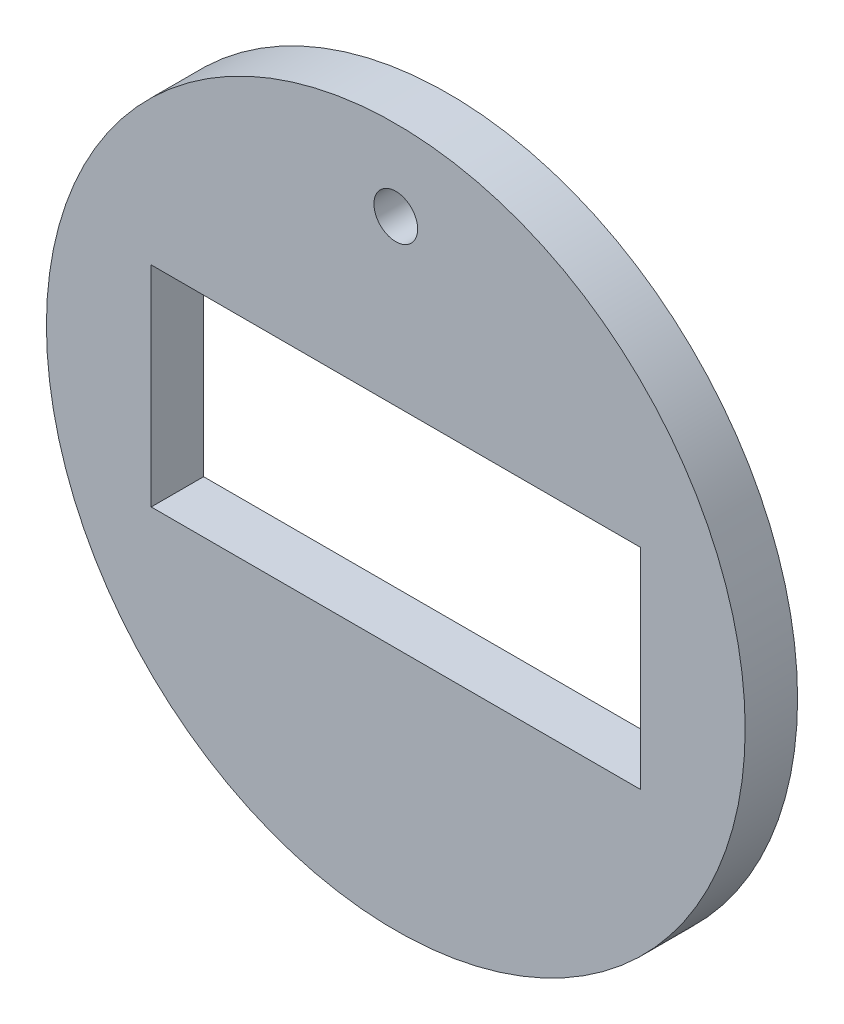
from build123d import *

# Parameters (mm, degrees)
SKETCH1_R          = 25.4
EXTRUDE1_DEPTH     = 3.81
SKETCH4_W          = 35.56
SKETCH4_H          = 15.24
CUT_EXTRUDE1_DEPTH = 37.122515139
SKETCH2_R          = 1.5875
CUT_EXTRUDE3_DEPTH = 37.122515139


with BuildPart() as part:
    # Sketch1 → Extrude1 (new body)
    with BuildSketch(Plane.XY):
        with Locations(Location((0, 0, 0), (0, 0, 180))):
            Circle(SKETCH1_R)
    extrude(amount=EXTRUDE1_DEPTH)

    # Sketch4 → Cut-Extrude1 (cut, through all)
    with BuildSketch(Plane.XY.offset(3.81)):
        Rectangle(SKETCH4_W, SKETCH4_H)
    extrude(amount=-CUT_EXTRUDE1_DEPTH, mode=Mode.SUBTRACT)

    # Sketch2 → Cut-Extrude3 (cut, through all)
    with BuildSketch(Plane.XY):
        with Locations(Location((0, 19.558, 0), (0, 0, 180))):
            Circle(SKETCH2_R)
    extrude(amount=CUT_EXTRUDE3_DEPTH, mode=Mode.SUBTRACT)


solid = part.part
